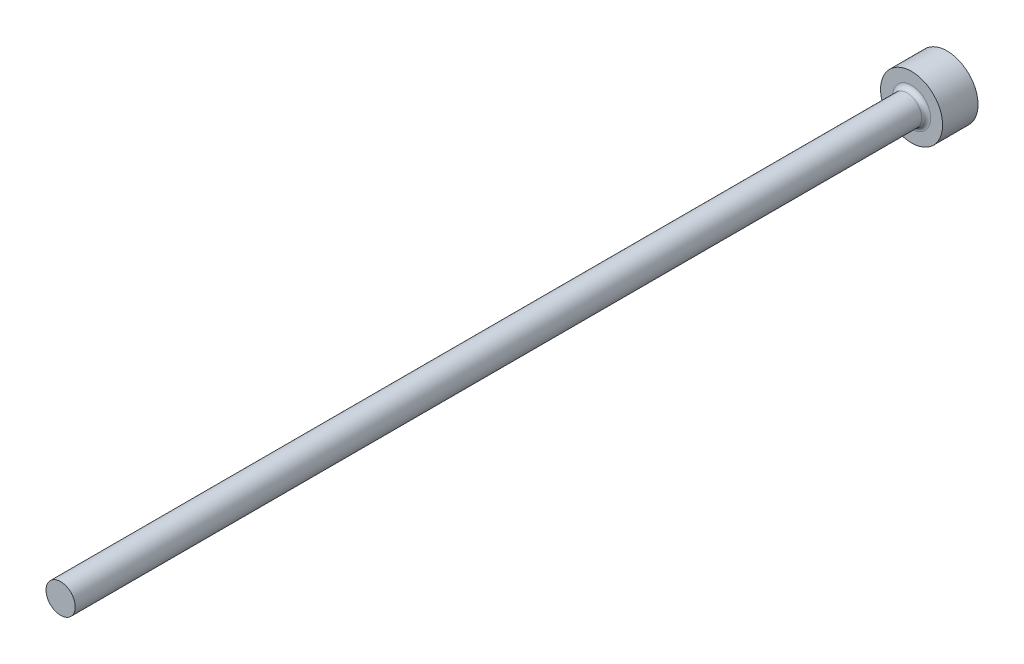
from build123d import *

# Parameters (mm, degrees)
FILLET1_R = 0.5


with BuildPart() as part:
    # FV → Revolve1 (revolve)
    with BuildSketch(Plane(origin=(0, 0, 0), x_dir=(1, 0, 0), z_dir=(0, 1, 0)), mode=Mode.PRIVATE) as revolve1_sk:
        Polygon((0, 0), (3.5, 0), (3.5, -4), (1.65, -4), (1.65, -100), (0, -100), align=None)
    revolve(revolve1_sk.sketch.rotate(Axis((0, 0, -9.033228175), (0, 0, 1)), 180), axis=Axis((0, 0, -9.033228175), (0, 0, 1)))

    # Fillet1
    fillet1_edges = [part.edges().sort_by_distance(p)[0] for p in [
        (1.65, 0, 4),
    ]]
    fillet(fillet1_edges, radius=FILLET1_R)


solid = part.part
